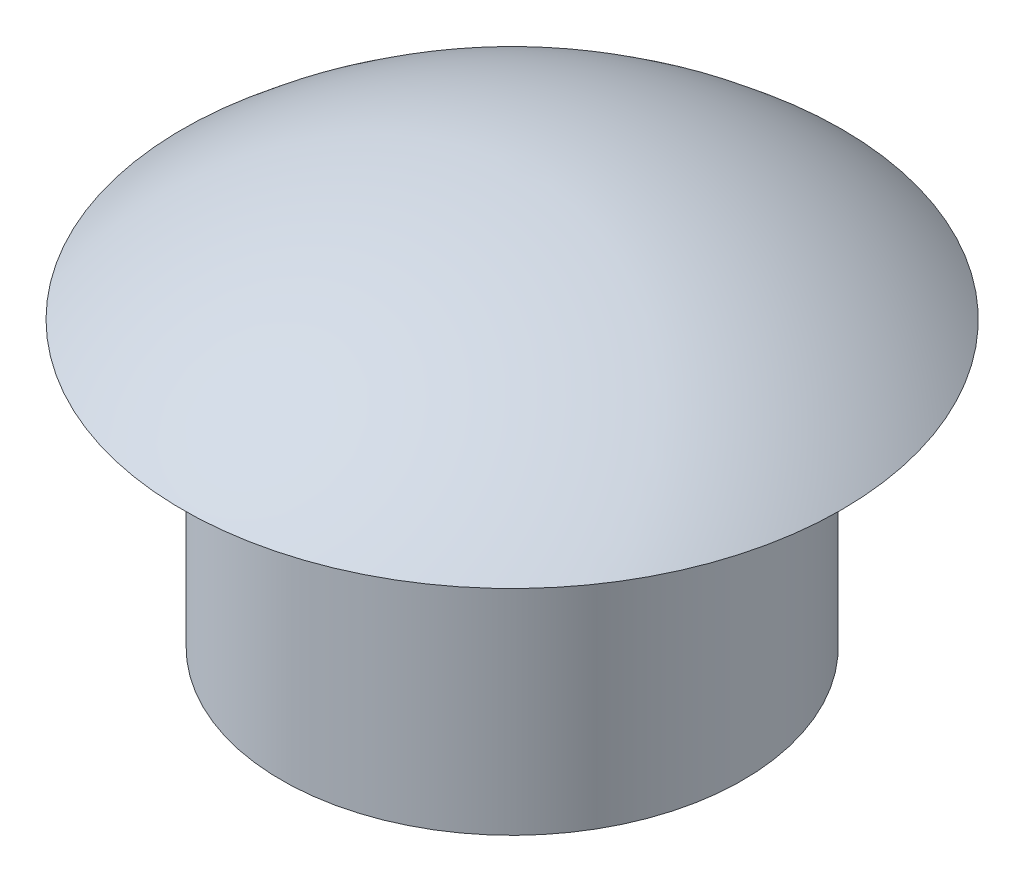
ISO-10303-21;
HEADER;
FILE_DESCRIPTION(('STEP AP214'),'2;1');
FILE_NAME('part.step','',(''),(''),'','','');
FILE_SCHEMA(('AUTOMOTIVE_DESIGN { 1 0 10303 214 1 1 1 1 }'));
ENDSEC;
DATA;
#1=APPLICATION_CONTEXT('core data for automotive mechanical design processes');
#2=APPLICATION_PROTOCOL_DEFINITION('international standard','automotive_design',2000,#1);
#3=PRODUCT_CONTEXT('',#1,'mechanical');
#4=PRODUCT('Part','Part','',(#3));
#5=PRODUCT_RELATED_PRODUCT_CATEGORY('part','',(#4));
#6=PRODUCT_DEFINITION_FORMATION('','',#4);
#7=PRODUCT_DEFINITION_CONTEXT('part definition',#1,'design');
#8=PRODUCT_DEFINITION('design','',#6,#7);
#9=PRODUCT_DEFINITION_SHAPE('','',#8);
#10=(LENGTH_UNIT() NAMED_UNIT(*) SI_UNIT(.MILLI.,.METRE.));
#11=(NAMED_UNIT(*) PLANE_ANGLE_UNIT() SI_UNIT($,.RADIAN.));
#12=(NAMED_UNIT(*) SI_UNIT($,.STERADIAN.) SOLID_ANGLE_UNIT());
#13=UNCERTAINTY_MEASURE_WITH_UNIT(LENGTH_MEASURE(1.E-05),#10,'distance_accuracy_value','');
#14=(GEOMETRIC_REPRESENTATION_CONTEXT(3) GLOBAL_UNCERTAINTY_ASSIGNED_CONTEXT((#13)) GLOBAL_UNIT_ASSIGNED_CONTEXT((#10,
#11,#12)) REPRESENTATION_CONTEXT('',''));
#15=CARTESIAN_POINT('',(0.,0.,0.));
#16=DIRECTION('',(0.,0.,1.));
#17=DIRECTION('',(1.,0.,0.));
#18=AXIS2_PLACEMENT_3D('',#15,#16,#17);
#19=CARTESIAN_POINT('',(0.,3.99997307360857,0.));
#20=DIRECTION('',(0.,-1.,0.));
#21=DIRECTION('',(0.,0.,-1.));
#22=AXIS2_PLACEMENT_3D('',#19,#20,#21);
#23=PLANE('',#22);
#24=CARTESIAN_POINT('',(0.,3.99997307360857,0.));
#25=DIRECTION('',(0.,-1.,0.));
#26=DIRECTION('',(0.,0.,-1.));
#27=AXIS2_PLACEMENT_3D('',#24,#25,#26);
#28=CIRCLE('',#27,1.75);
#29=CARTESIAN_POINT('',(0.,3.99997307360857,-1.75));
#30=VERTEX_POINT('',#29);
#31=EDGE_CURVE('E10',#30,#30,#28,.T.);
#32=ORIENTED_EDGE('',*,*,#31,.T.);
#33=EDGE_LOOP('',(#32));
#34=FACE_BOUND('',#33,.T.);
#35=ADVANCED_FACE('F24',(#34),#23,.T.);
#36=CARTESIAN_POINT('',(0.,0.,0.));
#37=DIRECTION('',(0.,-1.,0.));
#38=DIRECTION('',(0.,0.,-1.));
#39=AXIS2_PLACEMENT_3D('',#36,#37,#38);
#40=CYLINDRICAL_SURFACE('',#39,1.75);
#41=CARTESIAN_POINT('',(0.,-1.44988261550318E-05,0.));
#42=DIRECTION('',(0.,-1.,0.));
#43=DIRECTION('',(0.,0.,-1.));
#44=AXIS2_PLACEMENT_3D('',#41,#42,#43);
#45=CIRCLE('',#44,1.75);
#46=CARTESIAN_POINT('',(0.,-1.44988261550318E-05,-1.75));
#47=VERTEX_POINT('',#46);
#48=EDGE_CURVE('E30',#47,#47,#45,.T.);
#49=ORIENTED_EDGE('',*,*,#48,.T.);
#50=EDGE_LOOP('',(#49));
#51=FACE_BOUND('',#50,.T.);
#52=ORIENTED_EDGE('',*,*,#31,.F.);
#53=EDGE_LOOP('',(#52));
#54=FACE_BOUND('',#53,.T.);
#55=ADVANCED_FACE('F59',(#51,#54),#40,.F.);
#56=CARTESIAN_POINT('',(0.,-1.44988261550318E-05,0.));
#57=DIRECTION('',(0.,-1.,0.));
#58=DIRECTION('',(0.,0.,-1.));
#59=AXIS2_PLACEMENT_3D('',#56,#57,#58);
#60=CONICAL_SURFACE('',#59,1.75,1.57078804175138);
#61=CARTESIAN_POINT('',(0.,-2.69263914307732E-05,0.));
#62=DIRECTION('',(0.,-1.,0.));
#63=DIRECTION('',(0.,0.,-1.));
#64=AXIS2_PLACEMENT_3D('',#61,#62,#63);
#65=CIRCLE('',#64,3.25);
#66=CARTESIAN_POINT('',(0.,-2.69263914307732E-05,-3.25));
#67=VERTEX_POINT('',#66);
#68=EDGE_CURVE('E34',#67,#67,#65,.T.);
#69=ORIENTED_EDGE('',*,*,#68,.T.);
#70=EDGE_LOOP('',(#69));
#71=FACE_BOUND('',#70,.T.);
#72=ORIENTED_EDGE('',*,*,#48,.F.);
#73=EDGE_LOOP('',(#72));
#74=FACE_BOUND('',#73,.T.);
#75=ADVANCED_FACE('F63',(#71,#74),#60,.F.);
#76=CARTESIAN_POINT('',(0.,0.,0.));
#77=DIRECTION('',(0.,-1.,0.));
#78=DIRECTION('',(0.,0.,-1.));
#79=AXIS2_PLACEMENT_3D('',#76,#77,#78);
#80=CYLINDRICAL_SURFACE('',#79,3.25);
#81=CARTESIAN_POINT('',(0.,3.99997307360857,0.));
#82=DIRECTION('',(0.,-1.,0.));
#83=DIRECTION('',(0.,0.,-1.));
#84=AXIS2_PLACEMENT_3D('',#81,#82,#83);
#85=CIRCLE('',#84,3.25);
#86=CARTESIAN_POINT('',(0.,3.99997307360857,-3.25));
#87=VERTEX_POINT('',#86);
#88=EDGE_CURVE('E38',#87,#87,#85,.T.);
#89=ORIENTED_EDGE('',*,*,#88,.T.);
#90=EDGE_LOOP('',(#89));
#91=FACE_BOUND('',#90,.T.);
#92=ORIENTED_EDGE('',*,*,#68,.F.);
#93=EDGE_LOOP('',(#92));
#94=FACE_BOUND('',#93,.T.);
#95=ADVANCED_FACE('F56',(#91,#94),#80,.T.);
#96=CARTESIAN_POINT('',(3.25,3.99997307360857,0.));
#97=DIRECTION('',(0.,-1.,0.));
#98=DIRECTION('',(0.,0.,-1.));
#99=AXIS2_PLACEMENT_3D('',#96,#97,#98);
#100=PLANE('',#99);
#101=CARTESIAN_POINT('',(0.,3.99997307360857,0.));
#102=DIRECTION('',(0.,-1.,0.));
#103=DIRECTION('',(0.,0.,-1.));
#104=AXIS2_PLACEMENT_3D('',#101,#102,#103);
#105=CIRCLE('',#104,4.64571203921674);
#106=CARTESIAN_POINT('',(0.,3.99997307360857,-4.64571203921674));
#107=VERTEX_POINT('',#106);
#108=EDGE_CURVE('E43',#107,#107,#105,.T.);
#109=ORIENTED_EDGE('',*,*,#108,.T.);
#110=EDGE_LOOP('',(#109));
#111=FACE_BOUND('',#110,.T.);
#112=ORIENTED_EDGE('',*,*,#88,.F.);
#113=EDGE_LOOP('',(#112));
#114=FACE_BOUND('',#113,.T.);
#115=ADVANCED_FACE('F47',(#111,#114),#100,.T.);
#116=CARTESIAN_POINT('',(0.,-1.3113346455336,0.));
#117=DIRECTION('',(0.,-1.,0.));
#118=DIRECTION('',(1.,0.,0.));
#119=AXIS2_PLACEMENT_3D('',#116,#117,#118);
#120=SPHERICAL_SURFACE('',#119,7.05638930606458);
#121=ORIENTED_EDGE('',*,*,#108,.F.);
#122=EDGE_LOOP('',(#121));
#123=FACE_BOUND('',#122,.T.);
#124=ADVANCED_FACE('F50',(#123),#120,.T.);
#125=CLOSED_SHELL('',(#35,#55,#75,#95,#115,#124));
#126=MANIFOLD_SOLID_BREP('B2',#125);
#127=ADVANCED_BREP_SHAPE_REPRESENTATION('',(#18,#126),#14);
#128=SHAPE_DEFINITION_REPRESENTATION(#9,#127);
ENDSEC;
END-ISO-10303-21;
